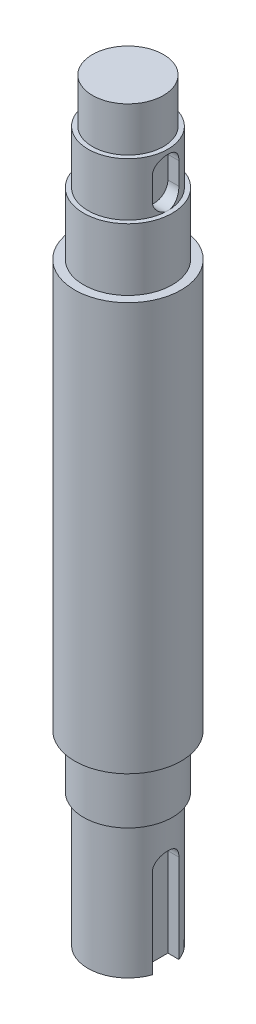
ISO-10303-21;
HEADER;
FILE_DESCRIPTION(('STEP AP214'),'2;1');
FILE_NAME('part.step','',(''),(''),'','','');
FILE_SCHEMA(('AUTOMOTIVE_DESIGN { 1 0 10303 214 1 1 1 1 }'));
ENDSEC;
DATA;
#1=APPLICATION_CONTEXT('core data for automotive mechanical design processes');
#2=APPLICATION_PROTOCOL_DEFINITION('international standard','automotive_design',2000,#1);
#3=PRODUCT_CONTEXT('',#1,'mechanical');
#4=PRODUCT('Part','Part','',(#3));
#5=PRODUCT_RELATED_PRODUCT_CATEGORY('part','',(#4));
#6=PRODUCT_DEFINITION_FORMATION('','',#4);
#7=PRODUCT_DEFINITION_CONTEXT('part definition',#1,'design');
#8=PRODUCT_DEFINITION('design','',#6,#7);
#9=PRODUCT_DEFINITION_SHAPE('','',#8);
#10=(LENGTH_UNIT() NAMED_UNIT(*) SI_UNIT(.MILLI.,.METRE.));
#11=(NAMED_UNIT(*) PLANE_ANGLE_UNIT() SI_UNIT($,.RADIAN.));
#12=(NAMED_UNIT(*) SI_UNIT($,.STERADIAN.) SOLID_ANGLE_UNIT());
#13=UNCERTAINTY_MEASURE_WITH_UNIT(LENGTH_MEASURE(1.E-05),#10,'distance_accuracy_value','');
#14=(GEOMETRIC_REPRESENTATION_CONTEXT(3) GLOBAL_UNCERTAINTY_ASSIGNED_CONTEXT((#13)) GLOBAL_UNIT_ASSIGNED_CONTEXT((#10,
#11,#12)) REPRESENTATION_CONTEXT('',''));
#15=CARTESIAN_POINT('',(0.,0.,0.));
#16=DIRECTION('',(0.,0.,1.));
#17=DIRECTION('',(1.,0.,0.));
#18=AXIS2_PLACEMENT_3D('',#15,#16,#17);
#19=CARTESIAN_POINT('',(0.,160.,0.));
#20=DIRECTION('',(0.,1.,0.));
#21=DIRECTION('',(0.,0.,1.));
#22=AXIS2_PLACEMENT_3D('',#19,#20,#21);
#23=PLANE('',#22);
#24=CARTESIAN_POINT('',(0.,160.,0.));
#25=DIRECTION('',(0.,-1.,0.));
#26=DIRECTION('',(0.,0.,-1.));
#27=AXIS2_PLACEMENT_3D('',#24,#25,#26);
#28=CIRCLE('',#27,8.);
#29=CARTESIAN_POINT('',(0.,160.,-8.));
#30=VERTEX_POINT('',#29);
#31=EDGE_CURVE('E20',#30,#30,#28,.T.);
#32=ORIENTED_EDGE('',*,*,#31,.F.);
#33=EDGE_LOOP('',(#32));
#34=FACE_BOUND('',#33,.T.);
#35=ADVANCED_FACE('F17',(#34),#23,.T.);
#36=CARTESIAN_POINT('',(6.,-10.,0.));
#37=DIRECTION('',(1.,0.,0.));
#38=DIRECTION('',(0.,0.,-1.));
#39=AXIS2_PLACEMENT_3D('',#36,#37,#38);
#40=PLANE('',#39);
#41=DIRECTION('',(0.,-1.,0.));
#42=VECTOR('',#41,1.);
#43=CARTESIAN_POINT('',(6.,-10.,3.));
#44=LINE('',#43,#42);
#45=CARTESIAN_POINT('',(6.,10.,3.));
#46=VERTEX_POINT('',#45);
#47=CARTESIAN_POINT('',(6.,-10.,3.));
#48=VERTEX_POINT('',#47);
#49=EDGE_CURVE('E82',#46,#48,#44,.T.);
#50=ORIENTED_EDGE('',*,*,#49,.T.);
#51=DIRECTION('',(0.,0.,-1.));
#52=VECTOR('',#51,1.);
#53=CARTESIAN_POINT('',(6.,-10.,0.));
#54=LINE('',#53,#52);
#55=CARTESIAN_POINT('',(6.,-10.,-3.));
#56=VERTEX_POINT('',#55);
#57=EDGE_CURVE('E112',#56,#48,#54,.F.);
#58=ORIENTED_EDGE('',*,*,#57,.F.);
#59=DIRECTION('',(0.,1.,0.));
#60=VECTOR('',#59,1.);
#61=CARTESIAN_POINT('',(6.,-10.,-3.));
#62=LINE('',#61,#60);
#63=CARTESIAN_POINT('',(6.,10.,-3.));
#64=VERTEX_POINT('',#63);
#65=EDGE_CURVE('E75',#56,#64,#62,.T.);
#66=ORIENTED_EDGE('',*,*,#65,.T.);
#67=CARTESIAN_POINT('',(6.,10.,0.));
#68=DIRECTION('',(1.,0.,0.));
#69=DIRECTION('',(0.,0.,-1.));
#70=AXIS2_PLACEMENT_3D('',#67,#68,#69);
#71=CIRCLE('',#70,3.);
#72=EDGE_CURVE('E79',#64,#46,#71,.T.);
#73=ORIENTED_EDGE('',*,*,#72,.T.);
#74=EDGE_LOOP('',(#50,#58,#66,#73));
#75=FACE_BOUND('',#74,.T.);
#76=ADVANCED_FACE('F81',(#75),#40,.T.);
#77=CARTESIAN_POINT('',(6.,150.,0.));
#78=DIRECTION('',(1.,0.,0.));
#79=DIRECTION('',(0.,0.,-1.));
#80=AXIS2_PLACEMENT_3D('',#77,#78,#79);
#81=PLANE('',#80);
#82=CARTESIAN_POINT('',(6.,146.,0.));
#83=DIRECTION('',(1.,0.,0.));
#84=DIRECTION('',(0.,0.,-1.));
#85=AXIS2_PLACEMENT_3D('',#82,#83,#84);
#86=CIRCLE('',#85,3.);
#87=CARTESIAN_POINT('',(6.,146.,-3.));
#88=VERTEX_POINT('',#87);
#89=CARTESIAN_POINT('',(6.,146.,3.));
#90=VERTEX_POINT('',#89);
#91=EDGE_CURVE('E111',#88,#90,#86,.T.);
#92=ORIENTED_EDGE('',*,*,#91,.T.);
#93=DIRECTION('',(0.,1.,0.));
#94=VECTOR('',#93,1.);
#95=CARTESIAN_POINT('',(6.,141.,3.));
#96=LINE('',#95,#94);
#97=CARTESIAN_POINT('',(6.,141.,3.));
#98=VERTEX_POINT('',#97);
#99=EDGE_CURVE('E110',#90,#98,#96,.F.);
#100=ORIENTED_EDGE('',*,*,#99,.T.);
#101=CARTESIAN_POINT('',(6.,141.,0.));
#102=DIRECTION('',(1.,0.,0.));
#103=DIRECTION('',(0.,0.,-1.));
#104=AXIS2_PLACEMENT_3D('',#101,#102,#103);
#105=CIRCLE('',#104,3.);
#106=CARTESIAN_POINT('',(6.,141.,-3.));
#107=VERTEX_POINT('',#106);
#108=EDGE_CURVE('E268',#98,#107,#105,.T.);
#109=ORIENTED_EDGE('',*,*,#108,.T.);
#110=DIRECTION('',(0.,1.,0.));
#111=VECTOR('',#110,1.);
#112=CARTESIAN_POINT('',(6.,141.,-3.));
#113=LINE('',#112,#111);
#114=EDGE_CURVE('E106',#107,#88,#113,.T.);
#115=ORIENTED_EDGE('',*,*,#114,.T.);
#116=EDGE_LOOP('',(#92,#100,#109,#115));
#117=FACE_BOUND('',#116,.T.);
#118=ADVANCED_FACE('F203',(#117),#81,.T.);
#119=CARTESIAN_POINT('',(0.,160.,0.));
#120=DIRECTION('',(0.,-1.,0.));
#121=DIRECTION('',(0.,0.,-1.));
#122=AXIS2_PLACEMENT_3D('',#119,#120,#121);
#123=CYLINDRICAL_SURFACE('',#122,8.);
#124=CARTESIAN_POINT('',(0.,150.,0.));
#125=DIRECTION('',(0.,-1.,0.));
#126=DIRECTION('',(0.,0.,-1.));
#127=AXIS2_PLACEMENT_3D('',#124,#125,#126);
#128=CIRCLE('',#127,8.);
#129=CARTESIAN_POINT('',(0.,150.,-8.));
#130=VERTEX_POINT('',#129);
#131=EDGE_CURVE('E190',#130,#130,#128,.T.);
#132=ORIENTED_EDGE('',*,*,#131,.F.);
#133=EDGE_LOOP('',(#132));
#134=FACE_BOUND('',#133,.T.);
#135=ORIENTED_EDGE('',*,*,#31,.T.);
#136=EDGE_LOOP('',(#135));
#137=FACE_BOUND('',#136,.T.);
#138=ADVANCED_FACE('F200',(#134,#137),#123,.T.);
#139=CARTESIAN_POINT('',(6.,-10.,3.));
#140=DIRECTION('',(0.,0.,1.));
#141=DIRECTION('',(0.,-1.,0.));
#142=AXIS2_PLACEMENT_3D('',#139,#140,#141);
#143=PLANE('',#142);
#144=DIRECTION('',(1.,0.,0.));
#145=VECTOR('',#144,1.);
#146=CARTESIAN_POINT('',(0.,-10.,3.));
#147=LINE('',#146,#145);
#148=CARTESIAN_POINT('',(8.48528137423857,-10.,3.));
#149=VERTEX_POINT('',#148);
#150=EDGE_CURVE('E93',#48,#149,#147,.T.);
#151=ORIENTED_EDGE('',*,*,#150,.F.);
#152=ORIENTED_EDGE('',*,*,#49,.F.);
#153=DIRECTION('',(1.,0.,0.));
#154=VECTOR('',#153,1.);
#155=CARTESIAN_POINT('',(6.,10.,3.));
#156=LINE('',#155,#154);
#157=CARTESIAN_POINT('',(8.48528137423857,10.,3.));
#158=VERTEX_POINT('',#157);
#159=EDGE_CURVE('E87',#46,#158,#156,.T.);
#160=ORIENTED_EDGE('',*,*,#159,.T.);
#161=DIRECTION('',(0.,-1.,0.));
#162=VECTOR('',#161,1.);
#163=CARTESIAN_POINT('',(8.48528137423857,20.,3.));
#164=LINE('',#163,#162);
#165=EDGE_CURVE('E189',#149,#158,#164,.F.);
#166=ORIENTED_EDGE('',*,*,#165,.F.);
#167=EDGE_LOOP('',(#151,#152,#160,#166));
#168=FACE_BOUND('',#167,.T.);
#169=ADVANCED_FACE('F89',(#168),#143,.F.);
#170=CARTESIAN_POINT('',(6.,10.,0.));
#171=DIRECTION('',(1.,0.,0.));
#172=DIRECTION('',(0.,0.,-1.));
#173=AXIS2_PLACEMENT_3D('',#170,#171,#172);
#174=CYLINDRICAL_SURFACE('',#173,3.);
#175=CARTESIAN_POINT('',(8.48528137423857,10.,3.));
#176=CARTESIAN_POINT('',(8.48526831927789,10.0818484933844,3.00001078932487));
#177=CARTESIAN_POINT('',(8.48646532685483,10.1636896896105,2.99665064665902));
#178=CARTESIAN_POINT('',(8.49118228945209,10.3267372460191,2.98327254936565));
#179=CARTESIAN_POINT('',(8.49470161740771,10.4079437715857,2.97325639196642));
#180=CARTESIAN_POINT('',(8.50395246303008,10.5689085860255,2.94668951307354));
#181=CARTESIAN_POINT('',(8.50967741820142,10.648670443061,2.93015817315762));
#182=CARTESIAN_POINT('',(8.52315143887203,10.8064099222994,2.89073017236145));
#183=CARTESIAN_POINT('',(8.53090057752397,10.884387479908,2.86783328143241));
#184=CARTESIAN_POINT('',(8.55683928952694,11.1147538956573,2.7898986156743));
#185=CARTESIAN_POINT('',(8.57773492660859,11.2638149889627,2.72557700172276));
#186=CARTESIAN_POINT('',(8.62436440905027,11.5490521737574,2.5742134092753));
#187=CARTESIAN_POINT('',(8.65010122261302,11.6852202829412,2.48715747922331));
#188=CARTESIAN_POINT('',(8.70463418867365,11.9461514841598,2.28915595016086));
#189=CARTESIAN_POINT('',(8.73350627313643,12.0703421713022,2.17747541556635));
#190=CARTESIAN_POINT('',(8.79041552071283,12.2986205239,1.93496485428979));
#191=CARTESIAN_POINT('',(8.81845253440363,12.402704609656,1.80413142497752));
#192=CARTESIAN_POINT('',(8.87141647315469,12.5904378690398,1.52281106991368));
#193=CARTESIAN_POINT('',(8.8962431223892,12.6734827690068,1.37190030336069));
#194=CARTESIAN_POINT('',(8.9390882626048,12.8127769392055,1.05728771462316));
#195=CARTESIAN_POINT('',(8.95710883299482,12.8690343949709,0.893589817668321));
#196=CARTESIAN_POINT('',(8.98377213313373,12.9512071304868,0.564088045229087));
#197=CARTESIAN_POINT('',(8.99271926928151,12.9781098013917,0.39855550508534));
#198=CARTESIAN_POINT('',(9.0013082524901,13.0039489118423,0.0650969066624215));
#199=CARTESIAN_POINT('',(9.00095231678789,13.0028920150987,-0.10282857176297));
#200=CARTESIAN_POINT('',(8.99118115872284,12.9734671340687,-0.429311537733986));
#201=CARTESIAN_POINT('',(8.98212182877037,12.9461720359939,-0.587978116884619));
#202=CARTESIAN_POINT('',(8.9564088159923,12.8668204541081,-0.89833218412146));
#203=CARTESIAN_POINT('',(8.93975471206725,12.8147625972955,-1.05001928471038));
#204=CARTESIAN_POINT('',(8.90027004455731,12.6867357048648,-1.34445790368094));
#205=CARTESIAN_POINT('',(8.8773611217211,12.6104611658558,-1.48706564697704));
#206=CARTESIAN_POINT('',(8.82775164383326,12.4364208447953,-1.757773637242));
#207=CARTESIAN_POINT('',(8.80105005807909,12.3386492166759,-1.88586992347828));
#208=CARTESIAN_POINT('',(8.74518810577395,12.1189841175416,-2.13029252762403));
#209=CARTESIAN_POINT('',(8.71597116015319,11.9961729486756,-2.24578277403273));
#210=CARTESIAN_POINT('',(8.65942491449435,11.7326859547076,-2.45481413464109));
#211=CARTESIAN_POINT('',(8.63209622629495,11.5920043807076,-2.54834815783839));
#212=CARTESIAN_POINT('',(8.58210018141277,11.2939199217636,-2.71201733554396));
#213=CARTESIAN_POINT('',(8.55950759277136,11.1363008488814,-2.78178668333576));
#214=CARTESIAN_POINT('',(8.5316849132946,10.8923158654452,-2.86551808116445));
#215=CARTESIAN_POINT('',(8.52342263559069,10.8097432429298,-2.889939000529));
#216=CARTESIAN_POINT('',(8.50917513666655,10.6426296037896,-2.93162549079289));
#217=CARTESIAN_POINT('',(8.50318887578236,10.5580895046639,-2.94889432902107));
#218=CARTESIAN_POINT('',(8.49410161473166,10.3947667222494,-2.97496555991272));
#219=CARTESIAN_POINT('',(8.49080270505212,10.3160871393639,-2.98435073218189));
#220=CARTESIAN_POINT('',(8.48638843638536,10.1582744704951,-2.99686829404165));
#221=CARTESIAN_POINT('',(8.48527025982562,10.0791421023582,-3.00000875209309));
#222=CARTESIAN_POINT('',(8.48528137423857,10.,-3.));
#223=B_SPLINE_CURVE_WITH_KNOTS('',3,(#175,#176,#177,#178,#179,#180,#181,#182,#183,#184,#185,
#186,#187,#188,#189,#190,#191,#192,#193,#194,#195,#196,#197,#198,#199,#200,#201,#202,#203,#204,
#205,#206,#207,#208,#209,#210,#211,#212,#213,#214,#215,#216,#217,#218,#219,#220,#221,#222),
.UNSPECIFIED.,.F.,.F.,(4,2,2,2,2,2,2,2,2,2,2,2,2,2,2,2,2,2,2,2,2,2,2,4),(0.,0.245455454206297,
0.490844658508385,0.73550931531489,0.980182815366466,1.46881220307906,1.95774215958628,
2.46393436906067,2.97021661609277,3.48971320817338,4.00905095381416,4.51032334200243,
5.01147626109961,5.4929717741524,5.97449398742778,6.46234978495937,6.9503384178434,
7.46126084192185,7.97234804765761,8.49098011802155,8.75020549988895,9.00931232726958,
9.24695816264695,9.4842967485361),.UNSPECIFIED.);
#224=CARTESIAN_POINT('',(8.48528137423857,10.,-3.));
#225=VERTEX_POINT('',#224);
#226=EDGE_CURVE('E98',#158,#225,#223,.T.);
#227=ORIENTED_EDGE('',*,*,#226,.F.);
#228=ORIENTED_EDGE('',*,*,#159,.F.);
#229=ORIENTED_EDGE('',*,*,#72,.F.);
#230=DIRECTION('',(1.,0.,0.));
#231=VECTOR('',#230,1.);
#232=CARTESIAN_POINT('',(6.,10.,-3.));
#233=LINE('',#232,#231);
#234=EDGE_CURVE('E101',#64,#225,#233,.T.);
#235=ORIENTED_EDGE('',*,*,#234,.T.);
#236=EDGE_LOOP('',(#227,#228,#229,#235));
#237=FACE_BOUND('',#236,.T.);
#238=ADVANCED_FACE('F96',(#237),#174,.F.);
#239=CARTESIAN_POINT('',(6.,-10.,-3.));
#240=DIRECTION('',(0.,0.,-1.));
#241=DIRECTION('',(0.,1.,0.));
#242=AXIS2_PLACEMENT_3D('',#239,#240,#241);
#243=PLANE('',#242);
#244=ORIENTED_EDGE('',*,*,#234,.F.);
#245=ORIENTED_EDGE('',*,*,#65,.F.);
#246=DIRECTION('',(1.,0.,0.));
#247=VECTOR('',#246,1.);
#248=CARTESIAN_POINT('',(0.,-10.,-3.));
#249=LINE('',#248,#247);
#250=CARTESIAN_POINT('',(8.48528137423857,-10.,-3.));
#251=VERTEX_POINT('',#250);
#252=EDGE_CURVE('E117',#251,#56,#249,.F.);
#253=ORIENTED_EDGE('',*,*,#252,.F.);
#254=DIRECTION('',(0.,-1.,0.));
#255=VECTOR('',#254,1.);
#256=CARTESIAN_POINT('',(8.48528137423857,20.,-3.));
#257=LINE('',#256,#255);
#258=EDGE_CURVE('E183',#225,#251,#257,.T.);
#259=ORIENTED_EDGE('',*,*,#258,.F.);
#260=EDGE_LOOP('',(#244,#245,#253,#259));
#261=FACE_BOUND('',#260,.T.);
#262=ADVANCED_FACE('F196',(#261),#243,.F.);
#263=CARTESIAN_POINT('',(0.,-10.,0.));
#264=DIRECTION('',(0.,-1.,0.));
#265=DIRECTION('',(0.,0.,-1.));
#266=AXIS2_PLACEMENT_3D('',#263,#264,#265);
#267=PLANE('',#266);
#268=ORIENTED_EDGE('',*,*,#252,.T.);
#269=ORIENTED_EDGE('',*,*,#57,.T.);
#270=ORIENTED_EDGE('',*,*,#150,.T.);
#271=CARTESIAN_POINT('',(0.,-10.,0.));
#272=DIRECTION('',(0.,-1.,0.));
#273=DIRECTION('',(0.,0.,-1.));
#274=AXIS2_PLACEMENT_3D('',#271,#272,#273);
#275=CIRCLE('',#274,9.);
#276=EDGE_CURVE('E181',#251,#149,#275,.F.);
#277=ORIENTED_EDGE('',*,*,#276,.F.);
#278=EDGE_LOOP('',(#268,#269,#270,#277));
#279=FACE_BOUND('',#278,.T.);
#280=ADVANCED_FACE('F259',(#279),#267,.T.);
#281=CARTESIAN_POINT('',(-6.52996408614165,141.,3.));
#282=DIRECTION('',(0.,0.,1.));
#283=DIRECTION('',(1.,0.,0.));
#284=AXIS2_PLACEMENT_3D('',#281,#282,#283);
#285=PLANE('',#284);
#286=DIRECTION('',(1.,0.,0.));
#287=VECTOR('',#286,1.);
#288=CARTESIAN_POINT('',(6.,141.,3.));
#289=LINE('',#288,#287);
#290=CARTESIAN_POINT('',(8.48528137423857,141.,3.));
#291=VERTEX_POINT('',#290);
#292=EDGE_CURVE('E269',#291,#98,#289,.F.);
#293=ORIENTED_EDGE('',*,*,#292,.T.);
#294=ORIENTED_EDGE('',*,*,#99,.F.);
#295=DIRECTION('',(1.,0.,0.));
#296=VECTOR('',#295,1.);
#297=CARTESIAN_POINT('',(-6.52996408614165,146.,3.));
#298=LINE('',#297,#296);
#299=CARTESIAN_POINT('',(8.48528137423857,146.,3.));
#300=VERTEX_POINT('',#299);
#301=EDGE_CURVE('E109',#90,#300,#298,.T.);
#302=ORIENTED_EDGE('',*,*,#301,.T.);
#303=DIRECTION('',(0.,1.,0.));
#304=VECTOR('',#303,1.);
#305=CARTESIAN_POINT('',(8.48528137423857,138.,3.));
#306=LINE('',#305,#304);
#307=EDGE_CURVE('E180',#291,#300,#306,.T.);
#308=ORIENTED_EDGE('',*,*,#307,.F.);
#309=EDGE_LOOP('',(#293,#294,#302,#308));
#310=FACE_BOUND('',#309,.T.);
#311=ADVANCED_FACE('F285',(#310),#285,.F.);
#312=CARTESIAN_POINT('',(-6.52996408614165,146.,0.));
#313=DIRECTION('',(1.,0.,0.));
#314=DIRECTION('',(0.,0.,-1.));
#315=AXIS2_PLACEMENT_3D('',#312,#313,#314);
#316=CYLINDRICAL_SURFACE('',#315,3.);
#317=CARTESIAN_POINT('',(8.48528137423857,146.,3.));
#318=CARTESIAN_POINT('',(8.48526831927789,146.081848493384,3.00001078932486));
#319=CARTESIAN_POINT('',(8.48646532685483,146.16368968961,2.99665064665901));
#320=CARTESIAN_POINT('',(8.49118228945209,146.326737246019,2.98327254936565));
#321=CARTESIAN_POINT('',(8.49470161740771,146.407943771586,2.97325639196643));
#322=CARTESIAN_POINT('',(8.50395246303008,146.568908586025,2.94668951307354));
#323=CARTESIAN_POINT('',(8.50967741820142,146.648670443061,2.93015817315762));
#324=CARTESIAN_POINT('',(8.52315143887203,146.806409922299,2.89073017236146));
#325=CARTESIAN_POINT('',(8.53090057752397,146.884387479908,2.86783328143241));
#326=CARTESIAN_POINT('',(8.55683928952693,147.114753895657,2.78989861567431));
#327=CARTESIAN_POINT('',(8.57773492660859,147.263814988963,2.72557700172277));
#328=CARTESIAN_POINT('',(8.62436440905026,147.549052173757,2.57421340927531));
#329=CARTESIAN_POINT('',(8.65010122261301,147.685220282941,2.48715747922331));
#330=CARTESIAN_POINT('',(8.70463418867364,147.94615148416,2.28915595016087));
#331=CARTESIAN_POINT('',(8.73350627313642,148.070342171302,2.17747541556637));
#332=CARTESIAN_POINT('',(8.79041552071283,148.2986205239,1.93496485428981));
#333=CARTESIAN_POINT('',(8.81845253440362,148.402704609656,1.80413142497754));
#334=CARTESIAN_POINT('',(8.87141647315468,148.59043786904,1.52281106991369));
#335=CARTESIAN_POINT('',(8.8962431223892,148.673482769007,1.37190030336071));
#336=CARTESIAN_POINT('',(8.93908826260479,148.812776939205,1.05728771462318));
#337=CARTESIAN_POINT('',(8.95710883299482,148.869034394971,0.893589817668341));
#338=CARTESIAN_POINT('',(8.98377213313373,148.951207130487,0.564088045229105));
#339=CARTESIAN_POINT('',(8.99271926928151,148.978109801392,0.398555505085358));
#340=CARTESIAN_POINT('',(9.0013082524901,149.003948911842,0.0650969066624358));
#341=CARTESIAN_POINT('',(9.00095231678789,149.002892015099,-0.102828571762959));
#342=CARTESIAN_POINT('',(8.99118115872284,148.973467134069,-0.429311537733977));
#343=CARTESIAN_POINT('',(8.98212182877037,148.946172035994,-0.587978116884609));
#344=CARTESIAN_POINT('',(8.9564088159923,148.866820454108,-0.89833218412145));
#345=CARTESIAN_POINT('',(8.93975471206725,148.814762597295,-1.05001928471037));
#346=CARTESIAN_POINT('',(8.90027004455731,148.686735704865,-1.34445790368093));
#347=CARTESIAN_POINT('',(8.8773611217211,148.610461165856,-1.48706564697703));
#348=CARTESIAN_POINT('',(8.82775164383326,148.436420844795,-1.757773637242));
#349=CARTESIAN_POINT('',(8.80105005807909,148.338649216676,-1.88586992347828));
#350=CARTESIAN_POINT('',(8.74518810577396,148.118984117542,-2.13029252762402));
#351=CARTESIAN_POINT('',(8.7159711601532,147.996172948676,-2.24578277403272));
#352=CARTESIAN_POINT('',(8.65942491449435,147.732685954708,-2.45481413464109));
#353=CARTESIAN_POINT('',(8.63209622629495,147.592004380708,-2.54834815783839));
#354=CARTESIAN_POINT('',(8.58210018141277,147.293919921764,-2.71201733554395));
#355=CARTESIAN_POINT('',(8.55950759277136,147.136300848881,-2.78178668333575));
#356=CARTESIAN_POINT('',(8.5316849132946,146.892315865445,-2.86551808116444));
#357=CARTESIAN_POINT('',(8.5234226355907,146.80974324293,-2.88993900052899));
#358=CARTESIAN_POINT('',(8.50917513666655,146.64262960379,-2.93162549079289));
#359=CARTESIAN_POINT('',(8.50318887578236,146.558089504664,-2.94889432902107));
#360=CARTESIAN_POINT('',(8.49410161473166,146.394766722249,-2.97496555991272));
#361=CARTESIAN_POINT('',(8.49080270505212,146.316087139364,-2.98435073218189));
#362=CARTESIAN_POINT('',(8.48638843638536,146.158274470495,-2.99686829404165));
#363=CARTESIAN_POINT('',(8.48527025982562,146.079142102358,-3.00000875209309));
#364=CARTESIAN_POINT('',(8.48528137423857,146.,-3.));
#365=B_SPLINE_CURVE_WITH_KNOTS('',3,(#317,#318,#319,#320,#321,#322,#323,#324,#325,#326,#327,
#328,#329,#330,#331,#332,#333,#334,#335,#336,#337,#338,#339,#340,#341,#342,#343,#344,#345,#346,
#347,#348,#349,#350,#351,#352,#353,#354,#355,#356,#357,#358,#359,#360,#361,#362,#363,#364),
.UNSPECIFIED.,.F.,.F.,(4,2,2,2,2,2,2,2,2,2,2,2,2,2,2,2,2,2,2,2,2,2,2,4),(0.,0.245455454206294,
0.490844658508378,0.735509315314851,0.980182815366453,1.46881220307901,1.95774215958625,
2.46393436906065,2.97021661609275,3.48971320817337,4.00905095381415,4.51032334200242,
5.01147626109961,5.4929717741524,5.97449398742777,6.46234978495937,6.9503384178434,
7.46126084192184,7.97234804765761,8.49098011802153,8.75020549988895,9.00931232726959,
9.24695816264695,9.48429674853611),.UNSPECIFIED.);
#366=CARTESIAN_POINT('',(8.48528137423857,146.,-3.));
#367=VERTEX_POINT('',#366);
#368=EDGE_CURVE('E152',#300,#367,#365,.T.);
#369=ORIENTED_EDGE('',*,*,#368,.F.);
#370=ORIENTED_EDGE('',*,*,#301,.F.);
#371=ORIENTED_EDGE('',*,*,#91,.F.);
#372=DIRECTION('',(-1.,0.,0.));
#373=VECTOR('',#372,1.);
#374=CARTESIAN_POINT('',(-6.52996408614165,146.,-3.));
#375=LINE('',#374,#373);
#376=EDGE_CURVE('E108',#88,#367,#375,.F.);
#377=ORIENTED_EDGE('',*,*,#376,.T.);
#378=EDGE_LOOP('',(#369,#370,#371,#377));
#379=FACE_BOUND('',#378,.T.);
#380=ADVANCED_FACE('F289',(#379),#316,.F.);
#381=CARTESIAN_POINT('',(-6.52996408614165,141.,-3.));
#382=DIRECTION('',(0.,0.,-1.));
#383=DIRECTION('',(-1.,0.,0.));
#384=AXIS2_PLACEMENT_3D('',#381,#382,#383);
#385=PLANE('',#384);
#386=ORIENTED_EDGE('',*,*,#376,.F.);
#387=ORIENTED_EDGE('',*,*,#114,.F.);
#388=DIRECTION('',(1.,0.,0.));
#389=VECTOR('',#388,1.);
#390=CARTESIAN_POINT('',(6.,141.,-3.));
#391=LINE('',#390,#389);
#392=CARTESIAN_POINT('',(8.48528137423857,141.,-3.));
#393=VERTEX_POINT('',#392);
#394=EDGE_CURVE('E263',#107,#393,#391,.T.);
#395=ORIENTED_EDGE('',*,*,#394,.T.);
#396=DIRECTION('',(0.,1.,0.));
#397=VECTOR('',#396,1.);
#398=CARTESIAN_POINT('',(8.48528137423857,138.,-3.));
#399=LINE('',#398,#397);
#400=EDGE_CURVE('E151',#367,#393,#399,.F.);
#401=ORIENTED_EDGE('',*,*,#400,.F.);
#402=EDGE_LOOP('',(#386,#387,#395,#401));
#403=FACE_BOUND('',#402,.T.);
#404=ADVANCED_FACE('F294',(#403),#385,.F.);
#405=CARTESIAN_POINT('',(6.,141.,0.));
#406=DIRECTION('',(1.,0.,0.));
#407=DIRECTION('',(0.,0.,-1.));
#408=AXIS2_PLACEMENT_3D('',#405,#406,#407);
#409=CYLINDRICAL_SURFACE('',#408,3.);
#410=ORIENTED_EDGE('',*,*,#394,.F.);
#411=ORIENTED_EDGE('',*,*,#108,.F.);
#412=ORIENTED_EDGE('',*,*,#292,.F.);
#413=CARTESIAN_POINT('',(9.,138.,0.));
#414=CARTESIAN_POINT('',(9.00001048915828,137.999989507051,0.0819793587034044));
#415=CARTESIAN_POINT('',(8.99888014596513,138.003360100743,0.163952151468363));
#416=CARTESIAN_POINT('',(8.99441584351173,138.016781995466,0.327270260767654));
#417=CARTESIAN_POINT('',(8.9910823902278,138.026831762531,0.408615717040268));
#418=CARTESIAN_POINT('',(8.98230207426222,138.053493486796,0.569878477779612));
#419=CARTESIAN_POINT('',(8.9768611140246,138.070087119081,0.649799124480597));
#420=CARTESIAN_POINT('',(8.96402050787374,138.10966946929,0.807858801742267));
#421=CARTESIAN_POINT('',(8.95662081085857,138.132658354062,0.885997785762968));
#422=CARTESIAN_POINT('',(8.93176574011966,138.210927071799,1.11687620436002));
#423=CARTESIAN_POINT('',(8.91164242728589,138.275543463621,1.26628333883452));
#424=CARTESIAN_POINT('',(8.86634083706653,138.42760002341,1.5521047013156));
#425=CARTESIAN_POINT('',(8.84115986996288,138.51505234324,1.68851195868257));
#426=CARTESIAN_POINT('',(8.78742426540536,138.71347133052,1.94921228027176));
#427=CARTESIAN_POINT('',(8.75878923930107,138.82508293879,2.0729986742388));
#428=CARTESIAN_POINT('',(8.70181164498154,139.06729205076,2.30049155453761));
#429=CARTESIAN_POINT('',(8.67346916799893,139.197895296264,2.40419194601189));
#430=CARTESIAN_POINT('',(8.61938995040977,139.479005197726,2.59150949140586));
#431=CARTESIAN_POINT('',(8.59375303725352,139.6299804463,2.67445440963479));
#432=CARTESIAN_POINT('',(8.54924349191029,139.944667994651,2.81350239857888));
#433=CARTESIAN_POINT('',(8.53036370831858,140.108366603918,2.8696338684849));
#434=CARTESIAN_POINT('',(8.50608188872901,140.39399214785,2.94067328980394));
#435=CARTESIAN_POINT('',(8.49834526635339,140.513956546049,2.96286311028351));
#436=CARTESIAN_POINT('',(8.48791627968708,140.755919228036,2.99254775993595));
#437=CARTESIAN_POINT('',(8.48522469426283,140.877917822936,3.00004032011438));
#438=CARTESIAN_POINT('',(8.48528137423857,141.,3.));
#439=B_SPLINE_CURVE_WITH_KNOTS('',3,(#413,#414,#415,#416,#417,#418,#419,#420,#421,#422,#423,
#424,#425,#426,#427,#428,#429,#430,#431,#432,#433,#434,#435,#436,#437,#438),.UNSPECIFIED.,.F.,
.F.,(4,2,2,2,2,2,2,2,2,2,2,2,4),(0.,0.245849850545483,0.491643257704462,0.736753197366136,
0.981869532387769,1.471481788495,1.96135511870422,2.46641554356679,2.97162898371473,
3.49154411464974,4.01090735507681,4.37668675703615,4.74252262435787),.UNSPECIFIED.);
#440=CARTESIAN_POINT('',(9.,138.,0.));
#441=VERTEX_POINT('',#440);
#442=EDGE_CURVE('E174',#441,#291,#439,.T.);
#443=ORIENTED_EDGE('',*,*,#442,.F.);
#444=CARTESIAN_POINT('',(8.48528137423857,141.,-3.));
#445=CARTESIAN_POINT('',(8.48526831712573,140.918148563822,-3.00001079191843));
#446=CARTESIAN_POINT('',(8.48646541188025,140.836304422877,-2.99665040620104));
#447=CARTESIAN_POINT('',(8.49118271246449,140.673251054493,-2.98327134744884));
#448=CARTESIAN_POINT('',(8.49470229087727,140.592041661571,-2.97325447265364));
#449=CARTESIAN_POINT('',(8.5039534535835,140.43107702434,-2.94668665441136));
#450=CARTESIAN_POINT('',(8.50967831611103,140.351318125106,-2.9301555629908));
#451=CARTESIAN_POINT('',(8.5231519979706,140.193584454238,-2.89072851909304));
#452=CARTESIAN_POINT('',(8.53090089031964,140.115609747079,-2.86783233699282));
#453=CARTESIAN_POINT('',(8.55683897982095,139.885248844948,-2.78989955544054));
#454=CARTESIAN_POINT('',(8.57773417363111,139.736190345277,-2.72557936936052));
#455=CARTESIAN_POINT('',(8.6243634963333,139.450952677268,-2.57421644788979));
#456=CARTESIAN_POINT('',(8.65010076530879,139.314781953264,-2.48715895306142));
#457=CARTESIAN_POINT('',(8.70463383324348,139.053850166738,-2.28915743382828));
#458=CARTESIAN_POINT('',(8.73350549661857,138.929661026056,-2.17747913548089));
#459=CARTESIAN_POINT('',(8.7904149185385,138.701381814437,-1.93496701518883));
#460=CARTESIAN_POINT('',(8.81845250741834,138.597295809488,-1.80412932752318));
#461=CARTESIAN_POINT('',(8.8714247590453,138.409532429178,-1.52276935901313));
#462=CARTESIAN_POINT('',(8.89625788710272,138.326466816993,-1.37181838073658));
#463=CARTESIAN_POINT('',(8.93910102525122,138.187183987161,-1.05716753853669));
#464=CARTESIAN_POINT('',(8.95711746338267,138.130941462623,-0.89347986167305));
#465=CARTESIAN_POINT('',(8.98025457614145,138.059631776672,-0.607559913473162));
#466=CARTESIAN_POINT('',(8.98760840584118,138.03732371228,-0.487266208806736));
#467=CARTESIAN_POINT('',(8.99750384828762,138.007488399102,-0.244674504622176));
#468=CARTESIAN_POINT('',(9.00004566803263,137.999960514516,-0.122376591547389));
#469=CARTESIAN_POINT('',(9.,138.,0.));
#470=B_SPLINE_CURVE_WITH_KNOTS('',3,(#444,#445,#446,#447,#448,#449,#450,#451,#452,#453,#454,
#455,#456,#457,#458,#459,#460,#461,#462,#463,#464,#465,#466,#467,#468,#469),.UNSPECIFIED.,.F.,
.F.,(4,2,2,2,2,2,2,2,2,2,2,2,4),(0.,0.245464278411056,0.490862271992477,0.735518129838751,
0.98018281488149,1.46880350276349,1.95774216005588,2.46392825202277,2.97021661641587,
3.48987942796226,4.00905097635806,4.37579528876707,4.74252382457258),.UNSPECIFIED.);
#471=EDGE_CURVE('E143',#393,#441,#470,.T.);
#472=ORIENTED_EDGE('',*,*,#471,.F.);
#473=EDGE_LOOP('',(#410,#411,#412,#443,#472));
#474=FACE_BOUND('',#473,.T.);
#475=ADVANCED_FACE('F158',(#474),#409,.F.);
#476=CARTESIAN_POINT('',(0.,150.,0.));
#477=DIRECTION('',(0.,1.,0.));
#478=DIRECTION('',(0.,0.,1.));
#479=AXIS2_PLACEMENT_3D('',#476,#477,#478);
#480=PLANE('',#479);
#481=ORIENTED_EDGE('',*,*,#131,.T.);
#482=EDGE_LOOP('',(#481));
#483=FACE_BOUND('',#482,.T.);
#484=CARTESIAN_POINT('',(0.,150.,0.));
#485=DIRECTION('',(0.,1.,0.));
#486=DIRECTION('',(0.,0.,1.));
#487=AXIS2_PLACEMENT_3D('',#484,#485,#486);
#488=CIRCLE('',#487,9.);
#489=CARTESIAN_POINT('',(0.,150.,9.));
#490=VERTEX_POINT('',#489);
#491=EDGE_CURVE('E140',#490,#490,#488,.F.);
#492=ORIENTED_EDGE('',*,*,#491,.F.);
#493=EDGE_LOOP('',(#492));
#494=FACE_BOUND('',#493,.T.);
#495=ADVANCED_FACE('F253',(#483,#494),#480,.T.);
#496=CARTESIAN_POINT('',(0.,20.,0.));
#497=DIRECTION('',(0.,-1.,0.));
#498=DIRECTION('',(0.,0.,-1.));
#499=AXIS2_PLACEMENT_3D('',#496,#497,#498);
#500=CYLINDRICAL_SURFACE('',#499,9.);
#501=CARTESIAN_POINT('',(0.,20.,0.));
#502=DIRECTION('',(0.,-1.,0.));
#503=DIRECTION('',(0.,0.,-1.));
#504=AXIS2_PLACEMENT_3D('',#501,#502,#503);
#505=CIRCLE('',#504,9.);
#506=CARTESIAN_POINT('',(0.,20.,-9.));
#507=VERTEX_POINT('',#506);
#508=EDGE_CURVE('E137',#507,#507,#505,.F.);
#509=ORIENTED_EDGE('',*,*,#508,.F.);
#510=EDGE_LOOP('',(#509));
#511=FACE_BOUND('',#510,.T.);
#512=ORIENTED_EDGE('',*,*,#276,.T.);
#513=ORIENTED_EDGE('',*,*,#165,.T.);
#514=ORIENTED_EDGE('',*,*,#226,.T.);
#515=ORIENTED_EDGE('',*,*,#258,.T.);
#516=EDGE_LOOP('',(#512,#513,#514,#515));
#517=FACE_BOUND('',#516,.T.);
#518=ADVANCED_FACE('F168',(#511,#517),#500,.T.);
#519=CARTESIAN_POINT('',(0.,138.,0.));
#520=DIRECTION('',(0.,1.,0.));
#521=DIRECTION('',(0.,0.,1.));
#522=AXIS2_PLACEMENT_3D('',#519,#520,#521);
#523=CYLINDRICAL_SURFACE('',#522,9.);
#524=ORIENTED_EDGE('',*,*,#471,.T.);
#525=CARTESIAN_POINT('',(0.,138.,0.));
#526=DIRECTION('',(0.,1.,0.));
#527=DIRECTION('',(0.,0.,1.));
#528=AXIS2_PLACEMENT_3D('',#525,#526,#527);
#529=CIRCLE('',#528,9.);
#530=EDGE_CURVE('E33',#441,#441,#529,.F.);
#531=ORIENTED_EDGE('',*,*,#530,.F.);
#532=ORIENTED_EDGE('',*,*,#442,.T.);
#533=ORIENTED_EDGE('',*,*,#307,.T.);
#534=ORIENTED_EDGE('',*,*,#368,.T.);
#535=ORIENTED_EDGE('',*,*,#400,.T.);
#536=EDGE_LOOP('',(#524,#531,#532,#533,#534,#535));
#537=FACE_BOUND('',#536,.T.);
#538=ORIENTED_EDGE('',*,*,#491,.T.);
#539=EDGE_LOOP('',(#538));
#540=FACE_BOUND('',#539,.T.);
#541=ADVANCED_FACE('F162',(#537,#540),#523,.T.);
#542=CARTESIAN_POINT('',(0.,20.,0.));
#543=DIRECTION('',(0.,-1.,0.));
#544=DIRECTION('',(0.,0.,-1.));
#545=AXIS2_PLACEMENT_3D('',#542,#543,#544);
#546=PLANE('',#545);
#547=CARTESIAN_POINT('',(0.,20.,0.));
#548=DIRECTION('',(0.,-1.,0.));
#549=DIRECTION('',(0.,0.,-1.));
#550=AXIS2_PLACEMENT_3D('',#547,#548,#549);
#551=CIRCLE('',#550,10.);
#552=CARTESIAN_POINT('',(0.,20.,-10.));
#553=VERTEX_POINT('',#552);
#554=EDGE_CURVE('E133',#553,#553,#551,.F.);
#555=ORIENTED_EDGE('',*,*,#554,.F.);
#556=EDGE_LOOP('',(#555));
#557=FACE_BOUND('',#556,.T.);
#558=ORIENTED_EDGE('',*,*,#508,.T.);
#559=EDGE_LOOP('',(#558));
#560=FACE_BOUND('',#559,.T.);
#561=ADVANCED_FACE('F167',(#557,#560),#546,.T.);
#562=CARTESIAN_POINT('',(0.,138.,0.));
#563=DIRECTION('',(0.,1.,0.));
#564=DIRECTION('',(0.,0.,1.));
#565=AXIS2_PLACEMENT_3D('',#562,#563,#564);
#566=PLANE('',#565);
#567=CARTESIAN_POINT('',(0.,138.,0.));
#568=DIRECTION('',(0.,-1.,0.));
#569=DIRECTION('',(0.,0.,-1.));
#570=AXIS2_PLACEMENT_3D('',#567,#568,#569);
#571=CIRCLE('',#570,10.);
#572=CARTESIAN_POINT('',(0.,138.,-10.));
#573=VERTEX_POINT('',#572);
#574=EDGE_CURVE('E130',#573,#573,#571,.T.);
#575=ORIENTED_EDGE('',*,*,#574,.F.);
#576=EDGE_LOOP('',(#575));
#577=FACE_BOUND('',#576,.T.);
#578=ORIENTED_EDGE('',*,*,#530,.T.);
#579=EDGE_LOOP('',(#578));
#580=FACE_BOUND('',#579,.T.);
#581=ADVANCED_FACE('F235',(#577,#580),#566,.T.);
#582=CARTESIAN_POINT('',(0.,150.,0.));
#583=DIRECTION('',(0.,-1.,0.));
#584=DIRECTION('',(0.,0.,-1.));
#585=AXIS2_PLACEMENT_3D('',#582,#583,#584);
#586=CYLINDRICAL_SURFACE('',#585,10.);
#587=ORIENTED_EDGE('',*,*,#554,.T.);
#588=EDGE_LOOP('',(#587));
#589=FACE_BOUND('',#588,.T.);
#590=CARTESIAN_POINT('',(0.,32.,0.));
#591=DIRECTION('',(0.,-1.,0.));
#592=DIRECTION('',(0.,0.,-1.));
#593=AXIS2_PLACEMENT_3D('',#590,#591,#592);
#594=CIRCLE('',#593,10.);
#595=CARTESIAN_POINT('',(0.,32.,-10.));
#596=VERTEX_POINT('',#595);
#597=EDGE_CURVE('E127',#596,#596,#594,.F.);
#598=ORIENTED_EDGE('',*,*,#597,.F.);
#599=EDGE_LOOP('',(#598));
#600=FACE_BOUND('',#599,.T.);
#601=ADVANCED_FACE('F232',(#589,#600),#586,.T.);
#602=CARTESIAN_POINT('',(0.,150.,0.));
#603=DIRECTION('',(0.,-1.,0.));
#604=DIRECTION('',(0.,0.,-1.));
#605=AXIS2_PLACEMENT_3D('',#602,#603,#604);
#606=CYLINDRICAL_SURFACE('',#605,10.);
#607=CARTESIAN_POINT('',(0.,124.,0.));
#608=DIRECTION('',(0.,-1.,0.));
#609=DIRECTION('',(0.,0.,-1.));
#610=AXIS2_PLACEMENT_3D('',#607,#608,#609);
#611=CIRCLE('',#610,10.);
#612=CARTESIAN_POINT('',(0.,124.,-10.));
#613=VERTEX_POINT('',#612);
#614=EDGE_CURVE('E124',#613,#613,#611,.T.);
#615=ORIENTED_EDGE('',*,*,#614,.F.);
#616=EDGE_LOOP('',(#615));
#617=FACE_BOUND('',#616,.T.);
#618=ORIENTED_EDGE('',*,*,#574,.T.);
#619=EDGE_LOOP('',(#618));
#620=FACE_BOUND('',#619,.T.);
#621=ADVANCED_FACE('F228',(#617,#620),#606,.T.);
#622=CARTESIAN_POINT('',(-10.,32.,0.));
#623=DIRECTION('',(0.,-1.,0.));
#624=DIRECTION('',(0.,0.,-1.));
#625=AXIS2_PLACEMENT_3D('',#622,#623,#624);
#626=PLANE('',#625);
#627=CARTESIAN_POINT('',(0.,32.,0.));
#628=DIRECTION('',(0.,1.,0.));
#629=DIRECTION('',(0.,0.,1.));
#630=AXIS2_PLACEMENT_3D('',#627,#628,#629);
#631=CIRCLE('',#630,12.);
#632=CARTESIAN_POINT('',(0.,32.,12.));
#633=VERTEX_POINT('',#632);
#634=EDGE_CURVE('E26',#633,#633,#631,.T.);
#635=ORIENTED_EDGE('',*,*,#634,.F.);
#636=EDGE_LOOP('',(#635));
#637=FACE_BOUND('',#636,.T.);
#638=ORIENTED_EDGE('',*,*,#597,.T.);
#639=EDGE_LOOP('',(#638));
#640=FACE_BOUND('',#639,.T.);
#641=ADVANCED_FACE('F221',(#637,#640),#626,.T.);
#642=CARTESIAN_POINT('',(-10.,124.,0.));
#643=DIRECTION('',(0.,1.,0.));
#644=DIRECTION('',(0.,0.,1.));
#645=AXIS2_PLACEMENT_3D('',#642,#643,#644);
#646=PLANE('',#645);
#647=ORIENTED_EDGE('',*,*,#614,.T.);
#648=EDGE_LOOP('',(#647));
#649=FACE_BOUND('',#648,.T.);
#650=CARTESIAN_POINT('',(0.,124.,0.));
#651=DIRECTION('',(0.,1.,0.));
#652=DIRECTION('',(0.,0.,1.));
#653=AXIS2_PLACEMENT_3D('',#650,#651,#652);
#654=CIRCLE('',#653,12.);
#655=CARTESIAN_POINT('',(0.,124.,12.));
#656=VERTEX_POINT('',#655);
#657=EDGE_CURVE('E11',#656,#656,#654,.F.);
#658=ORIENTED_EDGE('',*,*,#657,.F.);
#659=EDGE_LOOP('',(#658));
#660=FACE_BOUND('',#659,.T.);
#661=ADVANCED_FACE('F215',(#649,#660),#646,.T.);
#662=CARTESIAN_POINT('',(0.,150.,0.));
#663=DIRECTION('',(0.,1.,0.));
#664=DIRECTION('',(0.,0.,1.));
#665=AXIS2_PLACEMENT_3D('',#662,#663,#664);
#666=CYLINDRICAL_SURFACE('',#665,12.);
#667=ORIENTED_EDGE('',*,*,#657,.T.);
#668=EDGE_LOOP('',(#667));
#669=FACE_BOUND('',#668,.T.);
#670=ORIENTED_EDGE('',*,*,#634,.T.);
#671=EDGE_LOOP('',(#670));
#672=FACE_BOUND('',#671,.T.);
#673=ADVANCED_FACE('F213',(#669,#672),#666,.T.);
#674=CLOSED_SHELL('',(#35,#76,#118,#138,#169,#238,#262,#280,#311,#380,#404,#475,#495,#518,#541,
#561,#581,#601,#621,#641,#661,#673));
#675=MANIFOLD_SOLID_BREP('B1',#674);
#676=ADVANCED_BREP_SHAPE_REPRESENTATION('',(#18,#675),#14);
#677=SHAPE_DEFINITION_REPRESENTATION(#9,#676);
ENDSEC;
END-ISO-10303-21;
